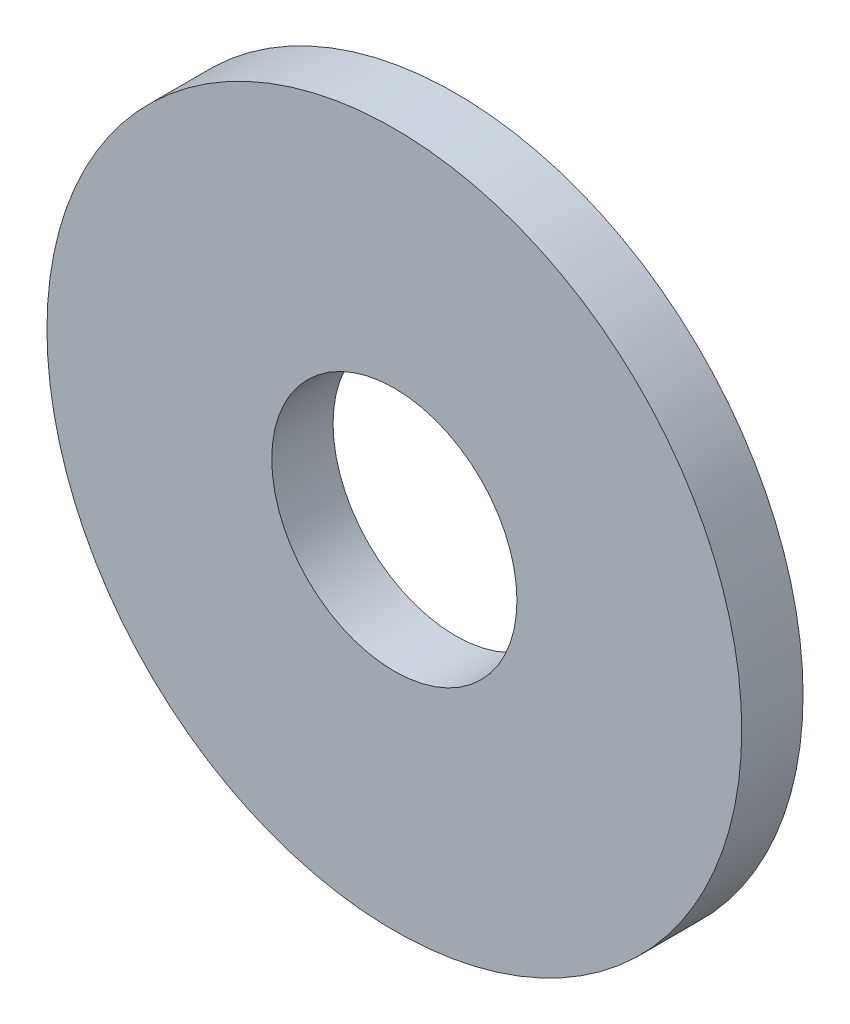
from build123d import *

# Parameters (mm, degrees)
ESQUISSE1_R      = 8.5
ESQUISSE1_R_2    = 3
EXTRUSION1_DEPTH = 1.5


with BuildPart() as part:
    # Esquisse1 → Extrusion1 (new body)
    with BuildSketch(Plane.XY):
        Circle(ESQUISSE1_R)
        Circle(ESQUISSE1_R_2, mode=Mode.SUBTRACT)
    extrude(amount=EXTRUSION1_DEPTH)


solid = part.part
